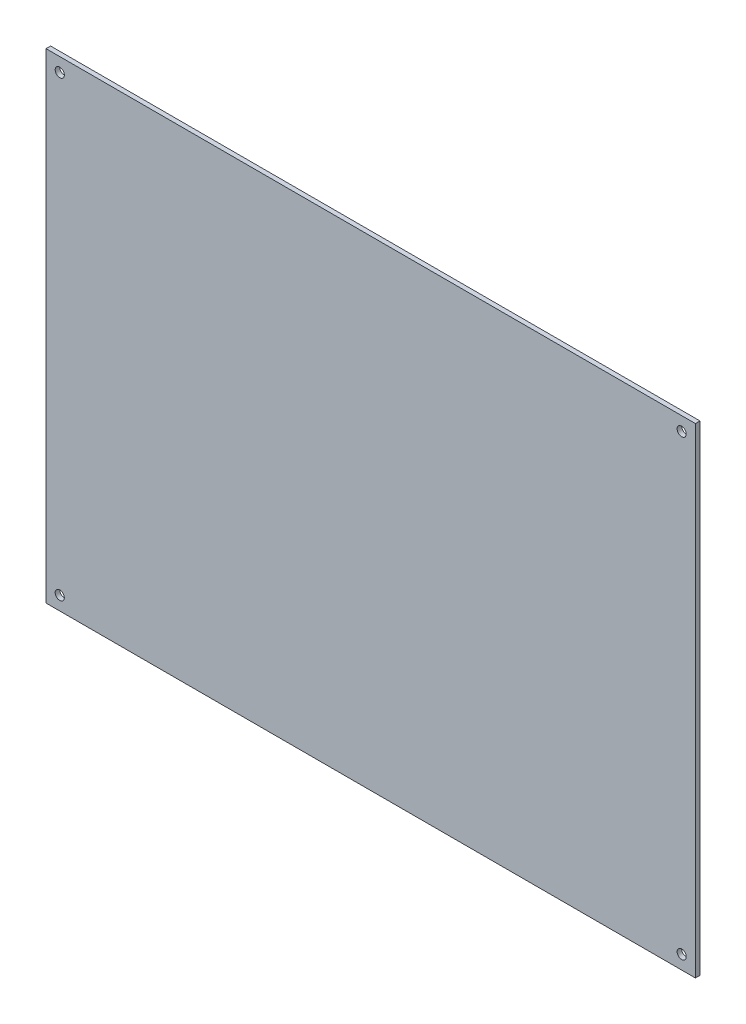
ISO-10303-21;
HEADER;
FILE_DESCRIPTION(('STEP AP214'),'2;1');
FILE_NAME('part.step','',(''),(''),'','','');
FILE_SCHEMA(('AUTOMOTIVE_DESIGN { 1 0 10303 214 1 1 1 1 }'));
ENDSEC;
DATA;
#1=APPLICATION_CONTEXT('core data for automotive mechanical design processes');
#2=APPLICATION_PROTOCOL_DEFINITION('international standard','automotive_design',2000,#1);
#3=PRODUCT_CONTEXT('',#1,'mechanical');
#4=PRODUCT('Part','Part','',(#3));
#5=PRODUCT_RELATED_PRODUCT_CATEGORY('part','',(#4));
#6=PRODUCT_DEFINITION_FORMATION('','',#4);
#7=PRODUCT_DEFINITION_CONTEXT('part definition',#1,'design');
#8=PRODUCT_DEFINITION('design','',#6,#7);
#9=PRODUCT_DEFINITION_SHAPE('','',#8);
#10=(LENGTH_UNIT() NAMED_UNIT(*) SI_UNIT(.MILLI.,.METRE.));
#11=(NAMED_UNIT(*) PLANE_ANGLE_UNIT() SI_UNIT($,.RADIAN.));
#12=(NAMED_UNIT(*) SI_UNIT($,.STERADIAN.) SOLID_ANGLE_UNIT());
#13=UNCERTAINTY_MEASURE_WITH_UNIT(LENGTH_MEASURE(1.E-05),#10,'distance_accuracy_value','');
#14=(GEOMETRIC_REPRESENTATION_CONTEXT(3) GLOBAL_UNCERTAINTY_ASSIGNED_CONTEXT((#13)) GLOBAL_UNIT_ASSIGNED_CONTEXT((#10,
#11,#12)) REPRESENTATION_CONTEXT('',''));
#15=CARTESIAN_POINT('',(0.,0.,0.));
#16=DIRECTION('',(0.,0.,1.));
#17=DIRECTION('',(1.,0.,0.));
#18=AXIS2_PLACEMENT_3D('',#15,#16,#17);
#19=CARTESIAN_POINT('',(0.,0.,2.54));
#20=DIRECTION('',(0.,0.,1.));
#21=DIRECTION('',(1.,0.,0.));
#22=AXIS2_PLACEMENT_3D('',#19,#20,#21);
#23=PLANE('',#22);
#24=CARTESIAN_POINT('',(170.824642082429,-88.1258785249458,2.54));
#25=DIRECTION('',(0.,0.,1.));
#26=DIRECTION('',(1.,0.,0.));
#27=AXIS2_PLACEMENT_3D('',#24,#25,#26);
#28=CIRCLE('',#27,2.53999999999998);
#29=CARTESIAN_POINT('',(173.364642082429,-88.1258785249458,2.54));
#30=VERTEX_POINT('',#29);
#31=EDGE_CURVE('E120',#30,#30,#28,.T.);
#32=ORIENTED_EDGE('',*,*,#31,.F.);
#33=EDGE_LOOP('',(#32));
#34=FACE_BOUND('',#33,.T.);
#35=CARTESIAN_POINT('',(-174.615357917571,163.334121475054,2.54));
#36=DIRECTION('',(0.,0.,1.));
#37=DIRECTION('',(1.,0.,0.));
#38=AXIS2_PLACEMENT_3D('',#35,#36,#37);
#39=CIRCLE('',#38,2.53999999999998);
#40=CARTESIAN_POINT('',(-172.075357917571,163.334121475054,2.54));
#41=VERTEX_POINT('',#40);
#42=EDGE_CURVE('E99',#41,#41,#39,.T.);
#43=ORIENTED_EDGE('',*,*,#42,.F.);
#44=EDGE_LOOP('',(#43));
#45=FACE_BOUND('',#44,.T.);
#46=DIRECTION('',(0.,-1.,0.));
#47=VECTOR('',#46,1.);
#48=CARTESIAN_POINT('',(-182.235357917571,170.954121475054,2.54));
#49=LINE('',#48,#47);
#50=CARTESIAN_POINT('',(-182.235357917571,170.954121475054,2.54));
#51=VERTEX_POINT('',#50);
#52=CARTESIAN_POINT('',(-182.235357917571,-95.7458785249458,2.54));
#53=VERTEX_POINT('',#52);
#54=EDGE_CURVE('E84',#51,#53,#49,.T.);
#55=ORIENTED_EDGE('',*,*,#54,.T.);
#56=DIRECTION('',(1.,0.,0.));
#57=VECTOR('',#56,1.);
#58=CARTESIAN_POINT('',(-182.235357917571,-95.7458785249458,2.54));
#59=LINE('',#58,#57);
#60=CARTESIAN_POINT('',(178.444642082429,-95.7458785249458,2.54));
#61=VERTEX_POINT('',#60);
#62=EDGE_CURVE('E79',#53,#61,#59,.T.);
#63=ORIENTED_EDGE('',*,*,#62,.T.);
#64=DIRECTION('',(0.,1.,0.));
#65=VECTOR('',#64,1.);
#66=CARTESIAN_POINT('',(178.444642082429,170.954121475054,2.54));
#67=LINE('',#66,#65);
#68=CARTESIAN_POINT('',(178.444642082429,170.954121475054,2.54));
#69=VERTEX_POINT('',#68);
#70=EDGE_CURVE('E82',#61,#69,#67,.T.);
#71=ORIENTED_EDGE('',*,*,#70,.T.);
#72=DIRECTION('',(-1.,0.,0.));
#73=VECTOR('',#72,1.);
#74=CARTESIAN_POINT('',(-182.235357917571,170.954121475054,2.54));
#75=LINE('',#74,#73);
#76=EDGE_CURVE('E49',#69,#51,#75,.T.);
#77=ORIENTED_EDGE('',*,*,#76,.T.);
#78=EDGE_LOOP('',(#55,#63,#71,#77));
#79=FACE_BOUND('',#78,.T.);
#80=CARTESIAN_POINT('',(-174.615357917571,-88.1258785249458,2.54));
#81=DIRECTION('',(0.,0.,1.));
#82=DIRECTION('',(1.,0.,0.));
#83=AXIS2_PLACEMENT_3D('',#80,#81,#82);
#84=CIRCLE('',#83,2.53999999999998);
#85=CARTESIAN_POINT('',(-172.075357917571,-88.1258785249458,2.54));
#86=VERTEX_POINT('',#85);
#87=EDGE_CURVE('E114',#86,#86,#84,.T.);
#88=ORIENTED_EDGE('',*,*,#87,.F.);
#89=EDGE_LOOP('',(#88));
#90=FACE_BOUND('',#89,.T.);
#91=CARTESIAN_POINT('',(170.824642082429,163.334121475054,2.54));
#92=DIRECTION('',(0.,0.,1.));
#93=DIRECTION('',(1.,0.,0.));
#94=AXIS2_PLACEMENT_3D('',#91,#92,#93);
#95=CIRCLE('',#94,2.53999999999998);
#96=CARTESIAN_POINT('',(173.364642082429,163.334121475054,2.54));
#97=VERTEX_POINT('',#96);
#98=EDGE_CURVE('E126',#97,#97,#95,.T.);
#99=ORIENTED_EDGE('',*,*,#98,.F.);
#100=EDGE_LOOP('',(#99));
#101=FACE_BOUND('',#100,.T.);
#102=ADVANCED_FACE('F32',(#34,#45,#79,#90,#101),#23,.T.);
#103=CARTESIAN_POINT('',(0.,0.,0.));
#104=DIRECTION('',(0.,0.,1.));
#105=DIRECTION('',(1.,0.,0.));
#106=AXIS2_PLACEMENT_3D('',#103,#104,#105);
#107=PLANE('',#106);
#108=DIRECTION('',(0.,-1.,0.));
#109=VECTOR('',#108,1.);
#110=CARTESIAN_POINT('',(-182.235357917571,170.954121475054,0.));
#111=LINE('',#110,#109);
#112=CARTESIAN_POINT('',(-182.235357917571,170.954121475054,0.));
#113=VERTEX_POINT('',#112);
#114=CARTESIAN_POINT('',(-182.235357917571,-95.7458785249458,0.));
#115=VERTEX_POINT('',#114);
#116=EDGE_CURVE('E96',#113,#115,#111,.T.);
#117=ORIENTED_EDGE('',*,*,#116,.F.);
#118=DIRECTION('',(-1.,0.,0.));
#119=VECTOR('',#118,1.);
#120=CARTESIAN_POINT('',(-182.235357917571,170.954121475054,0.));
#121=LINE('',#120,#119);
#122=CARTESIAN_POINT('',(178.444642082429,170.954121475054,0.));
#123=VERTEX_POINT('',#122);
#124=EDGE_CURVE('E72',#123,#113,#121,.T.);
#125=ORIENTED_EDGE('',*,*,#124,.F.);
#126=DIRECTION('',(0.,1.,0.));
#127=VECTOR('',#126,1.);
#128=CARTESIAN_POINT('',(178.444642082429,170.954121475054,0.));
#129=LINE('',#128,#127);
#130=CARTESIAN_POINT('',(178.444642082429,-95.7458785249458,0.));
#131=VERTEX_POINT('',#130);
#132=EDGE_CURVE('E66',#131,#123,#129,.T.);
#133=ORIENTED_EDGE('',*,*,#132,.F.);
#134=DIRECTION('',(1.,0.,0.));
#135=VECTOR('',#134,1.);
#136=CARTESIAN_POINT('',(-182.235357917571,-95.7458785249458,0.));
#137=LINE('',#136,#135);
#138=EDGE_CURVE('E88',#115,#131,#137,.T.);
#139=ORIENTED_EDGE('',*,*,#138,.F.);
#140=EDGE_LOOP('',(#117,#125,#133,#139));
#141=FACE_BOUND('',#140,.T.);
#142=CARTESIAN_POINT('',(-174.615357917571,163.334121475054,0.));
#143=DIRECTION('',(0.,0.,1.));
#144=DIRECTION('',(1.,0.,0.));
#145=AXIS2_PLACEMENT_3D('',#142,#143,#144);
#146=CIRCLE('',#145,2.53999999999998);
#147=CARTESIAN_POINT('',(-172.075357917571,163.334121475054,0.));
#148=VERTEX_POINT('',#147);
#149=EDGE_CURVE('E111',#148,#148,#146,.T.);
#150=ORIENTED_EDGE('',*,*,#149,.T.);
#151=EDGE_LOOP('',(#150));
#152=FACE_BOUND('',#151,.T.);
#153=CARTESIAN_POINT('',(-174.615357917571,-88.1258785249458,0.));
#154=DIRECTION('',(0.,0.,1.));
#155=DIRECTION('',(1.,0.,0.));
#156=AXIS2_PLACEMENT_3D('',#153,#154,#155);
#157=CIRCLE('',#156,2.53999999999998);
#158=CARTESIAN_POINT('',(-172.075357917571,-88.1258785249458,0.));
#159=VERTEX_POINT('',#158);
#160=EDGE_CURVE('E117',#159,#159,#157,.T.);
#161=ORIENTED_EDGE('',*,*,#160,.T.);
#162=EDGE_LOOP('',(#161));
#163=FACE_BOUND('',#162,.T.);
#164=CARTESIAN_POINT('',(170.824642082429,-88.1258785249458,0.));
#165=DIRECTION('',(0.,0.,1.));
#166=DIRECTION('',(1.,0.,0.));
#167=AXIS2_PLACEMENT_3D('',#164,#165,#166);
#168=CIRCLE('',#167,2.53999999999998);
#169=CARTESIAN_POINT('',(173.364642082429,-88.1258785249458,0.));
#170=VERTEX_POINT('',#169);
#171=EDGE_CURVE('E123',#170,#170,#168,.T.);
#172=ORIENTED_EDGE('',*,*,#171,.T.);
#173=EDGE_LOOP('',(#172));
#174=FACE_BOUND('',#173,.T.);
#175=CARTESIAN_POINT('',(170.824642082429,163.334121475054,0.));
#176=DIRECTION('',(0.,0.,1.));
#177=DIRECTION('',(1.,0.,0.));
#178=AXIS2_PLACEMENT_3D('',#175,#176,#177);
#179=CIRCLE('',#178,2.53999999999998);
#180=CARTESIAN_POINT('',(173.364642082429,163.334121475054,0.));
#181=VERTEX_POINT('',#180);
#182=EDGE_CURVE('E129',#181,#181,#179,.T.);
#183=ORIENTED_EDGE('',*,*,#182,.T.);
#184=EDGE_LOOP('',(#183));
#185=FACE_BOUND('',#184,.T.);
#186=ADVANCED_FACE('F107',(#141,#152,#163,#174,#185),#107,.F.);
#187=CARTESIAN_POINT('',(-182.235357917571,170.954121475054,2.54));
#188=DIRECTION('',(1.,0.,0.));
#189=DIRECTION('',(0.,0.,-1.));
#190=AXIS2_PLACEMENT_3D('',#187,#188,#189);
#191=PLANE('',#190);
#192=ORIENTED_EDGE('',*,*,#116,.T.);
#193=DIRECTION('',(0.,0.,-1.));
#194=VECTOR('',#193,1.);
#195=CARTESIAN_POINT('',(-182.235357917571,-95.7458785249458,2.54));
#196=LINE('',#195,#194);
#197=EDGE_CURVE('E11',#53,#115,#196,.T.);
#198=ORIENTED_EDGE('',*,*,#197,.F.);
#199=ORIENTED_EDGE('',*,*,#54,.F.);
#200=DIRECTION('',(0.,0.,-1.));
#201=VECTOR('',#200,1.);
#202=CARTESIAN_POINT('',(-182.235357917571,170.954121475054,2.54));
#203=LINE('',#202,#201);
#204=EDGE_CURVE('E92',#51,#113,#203,.T.);
#205=ORIENTED_EDGE('',*,*,#204,.T.);
#206=EDGE_LOOP('',(#192,#198,#199,#205));
#207=FACE_BOUND('',#206,.T.);
#208=ADVANCED_FACE('F34',(#207),#191,.F.);
#209=CARTESIAN_POINT('',(-182.235357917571,-95.7458785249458,2.54));
#210=DIRECTION('',(0.,1.,0.));
#211=DIRECTION('',(0.,0.,1.));
#212=AXIS2_PLACEMENT_3D('',#209,#210,#211);
#213=PLANE('',#212);
#214=ORIENTED_EDGE('',*,*,#138,.T.);
#215=DIRECTION('',(0.,0.,-1.));
#216=VECTOR('',#215,1.);
#217=CARTESIAN_POINT('',(178.444642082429,-95.7458785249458,2.54));
#218=LINE('',#217,#216);
#219=EDGE_CURVE('E41',#61,#131,#218,.T.);
#220=ORIENTED_EDGE('',*,*,#219,.F.);
#221=ORIENTED_EDGE('',*,*,#62,.F.);
#222=ORIENTED_EDGE('',*,*,#197,.T.);
#223=EDGE_LOOP('',(#214,#220,#221,#222));
#224=FACE_BOUND('',#223,.T.);
#225=ADVANCED_FACE('F87',(#224),#213,.F.);
#226=CARTESIAN_POINT('',(178.444642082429,170.954121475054,2.54));
#227=DIRECTION('',(-1.,0.,0.));
#228=DIRECTION('',(0.,-1.,0.));
#229=AXIS2_PLACEMENT_3D('',#226,#227,#228);
#230=PLANE('',#229);
#231=ORIENTED_EDGE('',*,*,#132,.T.);
#232=DIRECTION('',(0.,0.,-1.));
#233=VECTOR('',#232,1.);
#234=CARTESIAN_POINT('',(178.444642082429,170.954121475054,2.54));
#235=LINE('',#234,#233);
#236=EDGE_CURVE('E89',#69,#123,#235,.T.);
#237=ORIENTED_EDGE('',*,*,#236,.F.);
#238=ORIENTED_EDGE('',*,*,#70,.F.);
#239=ORIENTED_EDGE('',*,*,#219,.T.);
#240=EDGE_LOOP('',(#231,#237,#238,#239));
#241=FACE_BOUND('',#240,.T.);
#242=ADVANCED_FACE('F90',(#241),#230,.F.);
#243=CARTESIAN_POINT('',(-182.235357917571,170.954121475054,2.54));
#244=DIRECTION('',(0.,-1.,0.));
#245=DIRECTION('',(1.,0.,0.));
#246=AXIS2_PLACEMENT_3D('',#243,#244,#245);
#247=PLANE('',#246);
#248=ORIENTED_EDGE('',*,*,#124,.T.);
#249=ORIENTED_EDGE('',*,*,#204,.F.);
#250=ORIENTED_EDGE('',*,*,#76,.F.);
#251=ORIENTED_EDGE('',*,*,#236,.T.);
#252=EDGE_LOOP('',(#248,#249,#250,#251));
#253=FACE_BOUND('',#252,.T.);
#254=ADVANCED_FACE('F104',(#253),#247,.F.);
#255=CARTESIAN_POINT('',(-174.615357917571,163.334121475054,2.54));
#256=DIRECTION('',(0.,0.,-1.));
#257=DIRECTION('',(-1.,0.,0.));
#258=AXIS2_PLACEMENT_3D('',#255,#256,#257);
#259=CYLINDRICAL_SURFACE('',#258,2.53999999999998);
#260=ORIENTED_EDGE('',*,*,#42,.T.);
#261=EDGE_LOOP('',(#260));
#262=FACE_BOUND('',#261,.T.);
#263=ORIENTED_EDGE('',*,*,#149,.F.);
#264=EDGE_LOOP('',(#263));
#265=FACE_BOUND('',#264,.T.);
#266=ADVANCED_FACE('F148',(#262,#265),#259,.F.);
#267=CARTESIAN_POINT('',(-174.615357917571,-88.1258785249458,2.54));
#268=DIRECTION('',(0.,0.,-1.));
#269=DIRECTION('',(-1.,0.,0.));
#270=AXIS2_PLACEMENT_3D('',#267,#268,#269);
#271=CYLINDRICAL_SURFACE('',#270,2.53999999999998);
#272=ORIENTED_EDGE('',*,*,#87,.T.);
#273=EDGE_LOOP('',(#272));
#274=FACE_BOUND('',#273,.T.);
#275=ORIENTED_EDGE('',*,*,#160,.F.);
#276=EDGE_LOOP('',(#275));
#277=FACE_BOUND('',#276,.T.);
#278=ADVANCED_FACE('F194',(#274,#277),#271,.F.);
#279=CARTESIAN_POINT('',(170.824642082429,-88.1258785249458,2.54));
#280=DIRECTION('',(0.,0.,-1.));
#281=DIRECTION('',(-1.,0.,0.));
#282=AXIS2_PLACEMENT_3D('',#279,#280,#281);
#283=CYLINDRICAL_SURFACE('',#282,2.53999999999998);
#284=ORIENTED_EDGE('',*,*,#31,.T.);
#285=EDGE_LOOP('',(#284));
#286=FACE_BOUND('',#285,.T.);
#287=ORIENTED_EDGE('',*,*,#171,.F.);
#288=EDGE_LOOP('',(#287));
#289=FACE_BOUND('',#288,.T.);
#290=ADVANCED_FACE('F202',(#286,#289),#283,.F.);
#291=CARTESIAN_POINT('',(170.824642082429,163.334121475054,2.54));
#292=DIRECTION('',(0.,0.,-1.));
#293=DIRECTION('',(-1.,0.,0.));
#294=AXIS2_PLACEMENT_3D('',#291,#292,#293);
#295=CYLINDRICAL_SURFACE('',#294,2.53999999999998);
#296=ORIENTED_EDGE('',*,*,#98,.T.);
#297=EDGE_LOOP('',(#296));
#298=FACE_BOUND('',#297,.T.);
#299=ORIENTED_EDGE('',*,*,#182,.F.);
#300=EDGE_LOOP('',(#299));
#301=FACE_BOUND('',#300,.T.);
#302=ADVANCED_FACE('F135',(#298,#301),#295,.F.);
#303=CLOSED_SHELL('',(#102,#186,#208,#225,#242,#254,#266,#278,#290,#302));
#304=MANIFOLD_SOLID_BREP('B2',#303);
#305=ADVANCED_BREP_SHAPE_REPRESENTATION('',(#18,#304),#14);
#306=SHAPE_DEFINITION_REPRESENTATION(#9,#305);
ENDSEC;
END-ISO-10303-21;
